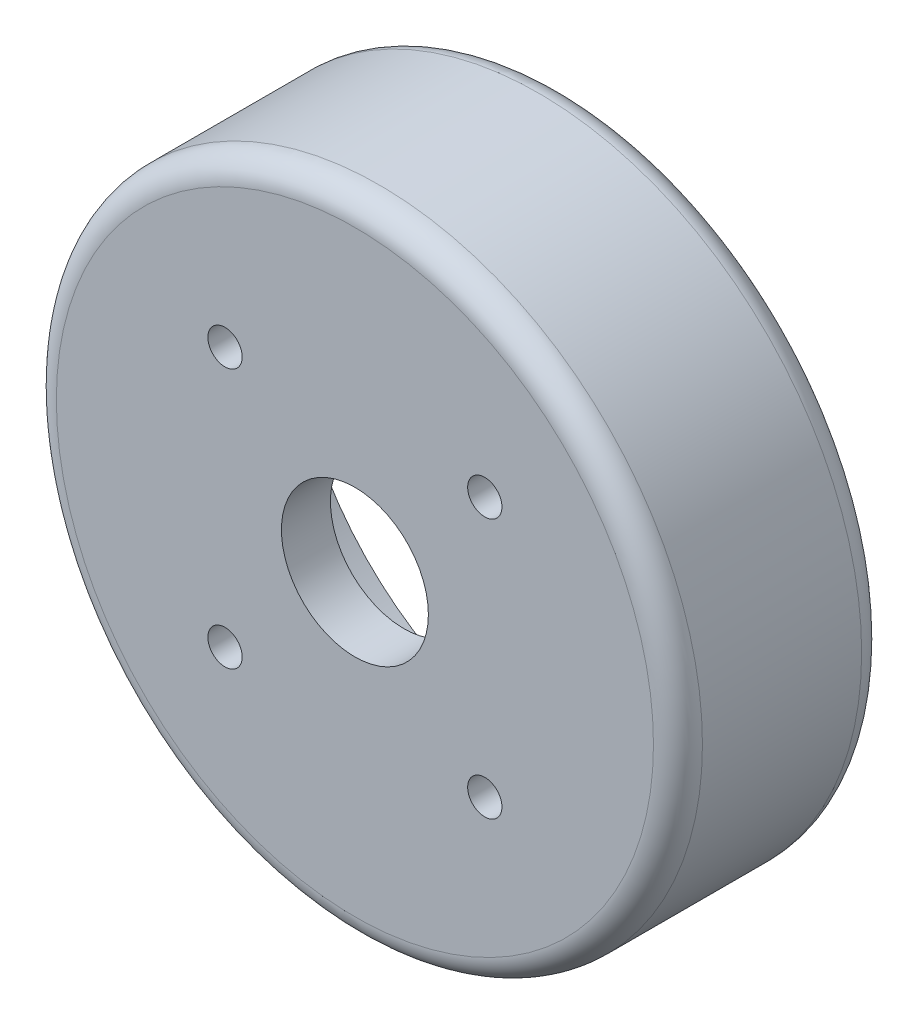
ISO-10303-21;
HEADER;
FILE_DESCRIPTION(('STEP AP214'),'2;1');
FILE_NAME('part.step','',(''),(''),'','','');
FILE_SCHEMA(('AUTOMOTIVE_DESIGN { 1 0 10303 214 1 1 1 1 }'));
ENDSEC;
DATA;
#1=APPLICATION_CONTEXT('core data for automotive mechanical design processes');
#2=APPLICATION_PROTOCOL_DEFINITION('international standard','automotive_design',2000,#1);
#3=PRODUCT_CONTEXT('',#1,'mechanical');
#4=PRODUCT('Part','Part','',(#3));
#5=PRODUCT_RELATED_PRODUCT_CATEGORY('part','',(#4));
#6=PRODUCT_DEFINITION_FORMATION('','',#4);
#7=PRODUCT_DEFINITION_CONTEXT('part definition',#1,'design');
#8=PRODUCT_DEFINITION('design','',#6,#7);
#9=PRODUCT_DEFINITION_SHAPE('','',#8);
#10=(LENGTH_UNIT() NAMED_UNIT(*) SI_UNIT(.MILLI.,.METRE.));
#11=(NAMED_UNIT(*) PLANE_ANGLE_UNIT() SI_UNIT($,.RADIAN.));
#12=(NAMED_UNIT(*) SI_UNIT($,.STERADIAN.) SOLID_ANGLE_UNIT());
#13=UNCERTAINTY_MEASURE_WITH_UNIT(LENGTH_MEASURE(1.E-05),#10,'distance_accuracy_value','');
#14=(GEOMETRIC_REPRESENTATION_CONTEXT(3) GLOBAL_UNCERTAINTY_ASSIGNED_CONTEXT((#13)) GLOBAL_UNIT_ASSIGNED_CONTEXT((#10,
#11,#12)) REPRESENTATION_CONTEXT('',''));
#15=CARTESIAN_POINT('',(0.,0.,0.));
#16=DIRECTION('',(0.,0.,1.));
#17=DIRECTION('',(1.,0.,0.));
#18=AXIS2_PLACEMENT_3D('',#15,#16,#17);
#19=CARTESIAN_POINT('',(-13.4703841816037,-13.4703841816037,8.89));
#20=DIRECTION('',(0.,0.,-1.));
#21=DIRECTION('',(-1.,0.,0.));
#22=AXIS2_PLACEMENT_3D('',#19,#20,#21);
#23=CYLINDRICAL_SURFACE('',#22,1.77799999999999);
#24=CARTESIAN_POINT('',(-13.4703841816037,-13.4703841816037,8.89));
#25=DIRECTION('',(0.,0.,-1.));
#26=DIRECTION('',(-1.,0.,0.));
#27=AXIS2_PLACEMENT_3D('',#24,#25,#26);
#28=CIRCLE('',#27,1.77799999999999);
#29=CARTESIAN_POINT('',(-15.2483841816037,-13.4703841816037,8.89));
#30=VERTEX_POINT('',#29);
#31=EDGE_CURVE('E396',#30,#30,#28,.T.);
#32=ORIENTED_EDGE('',*,*,#31,.F.);
#33=EDGE_LOOP('',(#32));
#34=FACE_BOUND('',#33,.T.);
#35=CARTESIAN_POINT('',(-13.4703841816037,-13.4703841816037,6.35));
#36=DIRECTION('',(0.,0.,-1.));
#37=DIRECTION('',(-1.,0.,0.));
#38=AXIS2_PLACEMENT_3D('',#35,#36,#37);
#39=CIRCLE('',#38,1.77799999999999);
#40=CARTESIAN_POINT('',(-15.2483841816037,-13.4703841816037,6.35));
#41=VERTEX_POINT('',#40);
#42=EDGE_CURVE('E366',#41,#41,#39,.F.);
#43=ORIENTED_EDGE('',*,*,#42,.F.);
#44=EDGE_LOOP('',(#43));
#45=FACE_BOUND('',#44,.T.);
#46=ADVANCED_FACE('F32',(#34,#45),#23,.F.);
#47=CARTESIAN_POINT('',(-13.4703841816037,13.4703841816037,8.89));
#48=DIRECTION('',(0.,0.,-1.));
#49=DIRECTION('',(-1.,0.,0.));
#50=AXIS2_PLACEMENT_3D('',#47,#48,#49);
#51=CYLINDRICAL_SURFACE('',#50,1.77799999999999);
#52=CARTESIAN_POINT('',(-13.4703841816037,13.4703841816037,8.89));
#53=DIRECTION('',(0.,0.,-1.));
#54=DIRECTION('',(-1.,0.,0.));
#55=AXIS2_PLACEMENT_3D('',#52,#53,#54);
#56=CIRCLE('',#55,1.77799999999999);
#57=CARTESIAN_POINT('',(-15.2483841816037,13.4703841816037,8.89));
#58=VERTEX_POINT('',#57);
#59=EDGE_CURVE('E400',#58,#58,#56,.T.);
#60=ORIENTED_EDGE('',*,*,#59,.F.);
#61=EDGE_LOOP('',(#60));
#62=FACE_BOUND('',#61,.T.);
#63=CARTESIAN_POINT('',(-13.4703841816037,13.4703841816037,6.35));
#64=DIRECTION('',(0.,0.,-1.));
#65=DIRECTION('',(-1.,0.,0.));
#66=AXIS2_PLACEMENT_3D('',#63,#64,#65);
#67=CIRCLE('',#66,1.77799999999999);
#68=CARTESIAN_POINT('',(-15.2483841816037,13.4703841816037,6.35));
#69=VERTEX_POINT('',#68);
#70=EDGE_CURVE('E428',#69,#69,#67,.F.);
#71=ORIENTED_EDGE('',*,*,#70,.F.);
#72=EDGE_LOOP('',(#71));
#73=FACE_BOUND('',#72,.T.);
#74=ADVANCED_FACE('F510',(#62,#73),#51,.F.);
#75=CARTESIAN_POINT('',(13.4703841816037,-13.4703841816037,8.89));
#76=DIRECTION('',(0.,0.,-1.));
#77=DIRECTION('',(-1.,0.,0.));
#78=AXIS2_PLACEMENT_3D('',#75,#76,#77);
#79=CYLINDRICAL_SURFACE('',#78,1.77799999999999);
#80=CARTESIAN_POINT('',(13.4703841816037,-13.4703841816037,8.89));
#81=DIRECTION('',(0.,0.,-1.));
#82=DIRECTION('',(-1.,0.,0.));
#83=AXIS2_PLACEMENT_3D('',#80,#81,#82);
#84=CIRCLE('',#83,1.77799999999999);
#85=CARTESIAN_POINT('',(11.6923841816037,-13.4703841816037,8.89));
#86=VERTEX_POINT('',#85);
#87=EDGE_CURVE('E393',#86,#86,#84,.T.);
#88=ORIENTED_EDGE('',*,*,#87,.F.);
#89=EDGE_LOOP('',(#88));
#90=FACE_BOUND('',#89,.T.);
#91=CARTESIAN_POINT('',(13.4703841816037,-13.4703841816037,6.35));
#92=DIRECTION('',(0.,0.,-1.));
#93=DIRECTION('',(-1.,0.,0.));
#94=AXIS2_PLACEMENT_3D('',#91,#92,#93);
#95=CIRCLE('',#94,1.77799999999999);
#96=CARTESIAN_POINT('',(11.6923841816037,-13.4703841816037,6.35));
#97=VERTEX_POINT('',#96);
#98=EDGE_CURVE('E242',#97,#97,#95,.F.);
#99=ORIENTED_EDGE('',*,*,#98,.F.);
#100=EDGE_LOOP('',(#99));
#101=FACE_BOUND('',#100,.T.);
#102=ADVANCED_FACE('F516',(#90,#101),#79,.F.);
#103=CARTESIAN_POINT('',(13.4703841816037,13.4703841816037,8.89));
#104=DIRECTION('',(0.,0.,-1.));
#105=DIRECTION('',(-1.,0.,0.));
#106=AXIS2_PLACEMENT_3D('',#103,#104,#105);
#107=CYLINDRICAL_SURFACE('',#106,1.77799999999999);
#108=CARTESIAN_POINT('',(13.4703841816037,13.4703841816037,8.89));
#109=DIRECTION('',(0.,0.,-1.));
#110=DIRECTION('',(-1.,0.,0.));
#111=AXIS2_PLACEMENT_3D('',#108,#109,#110);
#112=CIRCLE('',#111,1.77799999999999);
#113=CARTESIAN_POINT('',(11.6923841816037,13.4703841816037,8.89));
#114=VERTEX_POINT('',#113);
#115=EDGE_CURVE('E397',#114,#114,#112,.T.);
#116=ORIENTED_EDGE('',*,*,#115,.F.);
#117=EDGE_LOOP('',(#116));
#118=FACE_BOUND('',#117,.T.);
#119=CARTESIAN_POINT('',(13.4703841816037,13.4703841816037,6.35));
#120=DIRECTION('',(0.,0.,-1.));
#121=DIRECTION('',(-1.,0.,0.));
#122=AXIS2_PLACEMENT_3D('',#119,#120,#121);
#123=CIRCLE('',#122,1.77799999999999);
#124=CARTESIAN_POINT('',(11.6923841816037,13.4703841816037,6.35));
#125=VERTEX_POINT('',#124);
#126=EDGE_CURVE('E382',#125,#125,#123,.F.);
#127=ORIENTED_EDGE('',*,*,#126,.F.);
#128=EDGE_LOOP('',(#127));
#129=FACE_BOUND('',#128,.T.);
#130=ADVANCED_FACE('F452',(#118,#129),#107,.F.);
#131=CARTESIAN_POINT('',(0.,0.,-12.7));
#132=DIRECTION('',(0.,0.,1.));
#133=DIRECTION('',(1.,0.,0.));
#134=AXIS2_PLACEMENT_3D('',#131,#132,#133);
#135=CYLINDRICAL_SURFACE('',#134,33.5026);
#136=CARTESIAN_POINT('',(0.,0.,-10.16));
#137=DIRECTION('',(0.,0.,1.));
#138=DIRECTION('',(1.,0.,0.));
#139=AXIS2_PLACEMENT_3D('',#136,#137,#138);
#140=CIRCLE('',#139,33.5026);
#141=CARTESIAN_POINT('',(33.5026,0.,-10.16));
#142=VERTEX_POINT('',#141);
#143=EDGE_CURVE('E435',#142,#142,#140,.T.);
#144=ORIENTED_EDGE('',*,*,#143,.T.);
#145=EDGE_LOOP('',(#144));
#146=FACE_BOUND('',#145,.T.);
#147=CARTESIAN_POINT('',(0.,0.,6.35));
#148=DIRECTION('',(0.,0.,1.));
#149=DIRECTION('',(1.,0.,0.));
#150=AXIS2_PLACEMENT_3D('',#147,#148,#149);
#151=CIRCLE('',#150,33.5026);
#152=CARTESIAN_POINT('',(33.5026,0.,6.35));
#153=VERTEX_POINT('',#152);
#154=EDGE_CURVE('E423',#153,#153,#151,.F.);
#155=ORIENTED_EDGE('',*,*,#154,.T.);
#156=EDGE_LOOP('',(#155));
#157=FACE_BOUND('',#156,.T.);
#158=ADVANCED_FACE('F449',(#146,#157),#135,.T.);
#159=CARTESIAN_POINT('',(0.,0.,-12.7));
#160=DIRECTION('',(0.,0.,1.));
#161=DIRECTION('',(1.,0.,0.));
#162=AXIS2_PLACEMENT_3D('',#159,#160,#161);
#163=PLANE('',#162);
#164=CARTESIAN_POINT('',(0.,0.,-12.7));
#165=DIRECTION('',(0.,0.,1.));
#166=DIRECTION('',(1.,0.,0.));
#167=AXIS2_PLACEMENT_3D('',#164,#165,#166);
#168=CIRCLE('',#167,30.9626);
#169=CARTESIAN_POINT('',(30.9626,0.,-12.7));
#170=VERTEX_POINT('',#169);
#171=EDGE_CURVE('E40',#170,#170,#168,.F.);
#172=ORIENTED_EDGE('',*,*,#171,.T.);
#173=EDGE_LOOP('',(#172));
#174=FACE_BOUND('',#173,.T.);
#175=CARTESIAN_POINT('',(0.,0.,-12.7));
#176=DIRECTION('',(0.,0.,1.));
#177=DIRECTION('',(1.,0.,0.));
#178=AXIS2_PLACEMENT_3D('',#175,#176,#177);
#179=CIRCLE('',#178,28.4226);
#180=CARTESIAN_POINT('',(28.4226,0.,-12.7));
#181=VERTEX_POINT('',#180);
#182=EDGE_CURVE('E420',#181,#181,#179,.T.);
#183=ORIENTED_EDGE('',*,*,#182,.T.);
#184=EDGE_LOOP('',(#183));
#185=FACE_BOUND('',#184,.T.);
#186=ADVANCED_FACE('F440',(#174,#185),#163,.F.);
#187=CARTESIAN_POINT('',(0.,0.,-12.7));
#188=DIRECTION('',(0.,0.,1.));
#189=DIRECTION('',(1.,0.,0.));
#190=AXIS2_PLACEMENT_3D('',#187,#188,#189);
#191=CYLINDRICAL_SURFACE('',#190,28.4226);
#192=ORIENTED_EDGE('',*,*,#182,.F.);
#193=EDGE_LOOP('',(#192));
#194=FACE_BOUND('',#193,.T.);
#195=CARTESIAN_POINT('',(0.,0.,0.));
#196=DIRECTION('',(0.,0.,1.));
#197=DIRECTION('',(1.,0.,0.));
#198=AXIS2_PLACEMENT_3D('',#195,#196,#197);
#199=CIRCLE('',#198,28.4226);
#200=CARTESIAN_POINT('',(28.4226,0.,0.));
#201=VERTEX_POINT('',#200);
#202=EDGE_CURVE('E417',#201,#201,#199,.F.);
#203=ORIENTED_EDGE('',*,*,#202,.F.);
#204=EDGE_LOOP('',(#203));
#205=FACE_BOUND('',#204,.T.);
#206=ADVANCED_FACE('F497',(#194,#205),#191,.F.);
#207=CARTESIAN_POINT('',(0.,0.,0.));
#208=DIRECTION('',(0.,0.,1.));
#209=DIRECTION('',(1.,0.,0.));
#210=AXIS2_PLACEMENT_3D('',#207,#208,#209);
#211=PLANE('',#210);
#212=CARTESIAN_POINT('',(0.,0.,0.));
#213=DIRECTION('',(0.,0.,1.));
#214=DIRECTION('',(1.,0.,0.));
#215=AXIS2_PLACEMENT_3D('',#212,#213,#214);
#216=CIRCLE('',#215,25.4);
#217=CARTESIAN_POINT('',(-25.4,0.,0.));
#218=VERTEX_POINT('',#217);
#219=EDGE_CURVE('E414',#218,#218,#216,.T.);
#220=ORIENTED_EDGE('',*,*,#219,.T.);
#221=EDGE_LOOP('',(#220));
#222=FACE_BOUND('',#221,.T.);
#223=ORIENTED_EDGE('',*,*,#202,.T.);
#224=EDGE_LOOP('',(#223));
#225=FACE_BOUND('',#224,.T.);
#226=ADVANCED_FACE('F491',(#222,#225),#211,.F.);
#227=CARTESIAN_POINT('',(0.,0.,3.81));
#228=DIRECTION('',(0.,0.,-1.));
#229=DIRECTION('',(-1.,0.,0.));
#230=AXIS2_PLACEMENT_3D('',#227,#228,#229);
#231=CYLINDRICAL_SURFACE('',#230,25.4);
#232=CARTESIAN_POINT('',(0.,0.,3.81));
#233=DIRECTION('',(0.,0.,1.));
#234=DIRECTION('',(1.,0.,0.));
#235=AXIS2_PLACEMENT_3D('',#232,#233,#234);
#236=CIRCLE('',#235,25.4);
#237=CARTESIAN_POINT('',(-25.4,0.,3.81));
#238=VERTEX_POINT('',#237);
#239=EDGE_CURVE('E409',#238,#238,#236,.T.);
#240=CARTESIAN_POINT('',(-25.4,0.,3.81));
#241=CARTESIAN_POINT('',(-25.4,0.,3.7703125));
#242=CARTESIAN_POINT('',(-25.4,0.,3.730625));
#243=CARTESIAN_POINT('',(-25.4,0.,3.65125));
#244=CARTESIAN_POINT('',(-25.4,0.,3.6115625));
#245=CARTESIAN_POINT('',(-25.4,0.,3.5321875));
#246=CARTESIAN_POINT('',(-25.4,0.,3.4925));
#247=CARTESIAN_POINT('',(-25.4,0.,3.413125));
#248=CARTESIAN_POINT('',(-25.4,0.,3.3734375));
#249=CARTESIAN_POINT('',(-25.4,0.,3.2940625));
#250=CARTESIAN_POINT('',(-25.4,0.,3.254375));
#251=CARTESIAN_POINT('',(-25.4,0.,3.175));
#252=CARTESIAN_POINT('',(-25.4,0.,3.1353125));
#253=CARTESIAN_POINT('',(-25.4,0.,3.0559375));
#254=CARTESIAN_POINT('',(-25.4,0.,3.01625));
#255=CARTESIAN_POINT('',(-25.4,0.,2.936875));
#256=CARTESIAN_POINT('',(-25.4,0.,2.8971875));
#257=CARTESIAN_POINT('',(-25.4,0.,2.8178125));
#258=CARTESIAN_POINT('',(-25.4,0.,2.778125));
#259=CARTESIAN_POINT('',(-25.4,0.,2.69875));
#260=CARTESIAN_POINT('',(-25.4,0.,2.6590625));
#261=CARTESIAN_POINT('',(-25.4,0.,2.5796875));
#262=CARTESIAN_POINT('',(-25.4,0.,2.54));
#263=CARTESIAN_POINT('',(-25.4,0.,2.460625));
#264=CARTESIAN_POINT('',(-25.4,0.,2.4209375));
#265=CARTESIAN_POINT('',(-25.4,0.,2.3415625));
#266=CARTESIAN_POINT('',(-25.4,0.,2.301875));
#267=CARTESIAN_POINT('',(-25.4,0.,2.2225));
#268=CARTESIAN_POINT('',(-25.4,0.,2.1828125));
#269=CARTESIAN_POINT('',(-25.4,0.,2.1034375));
#270=CARTESIAN_POINT('',(-25.4,0.,2.06375));
#271=CARTESIAN_POINT('',(-25.4,0.,1.984375));
#272=CARTESIAN_POINT('',(-25.4,0.,1.9446875));
#273=CARTESIAN_POINT('',(-25.4,0.,1.8653125));
#274=CARTESIAN_POINT('',(-25.4,0.,1.825625));
#275=CARTESIAN_POINT('',(-25.4,0.,1.74625));
#276=CARTESIAN_POINT('',(-25.4,0.,1.7065625));
#277=CARTESIAN_POINT('',(-25.4,0.,1.6271875));
#278=CARTESIAN_POINT('',(-25.4,0.,1.5875));
#279=CARTESIAN_POINT('',(-25.4,0.,1.508125));
#280=CARTESIAN_POINT('',(-25.4,0.,1.4684375));
#281=CARTESIAN_POINT('',(-25.4,0.,1.3890625));
#282=CARTESIAN_POINT('',(-25.4,0.,1.349375));
#283=CARTESIAN_POINT('',(-25.4,0.,1.27));
#284=CARTESIAN_POINT('',(-25.4,0.,1.2303125));
#285=CARTESIAN_POINT('',(-25.4,0.,1.1509375));
#286=CARTESIAN_POINT('',(-25.4,0.,1.11125));
#287=CARTESIAN_POINT('',(-25.4,0.,1.031875));
#288=CARTESIAN_POINT('',(-25.4,0.,0.9921875));
#289=CARTESIAN_POINT('',(-25.4,0.,0.9128125));
#290=CARTESIAN_POINT('',(-25.4,0.,0.873125));
#291=CARTESIAN_POINT('',(-25.4,0.,0.79375));
#292=CARTESIAN_POINT('',(-25.4,0.,0.7540625));
#293=CARTESIAN_POINT('',(-25.4,0.,0.6746875));
#294=CARTESIAN_POINT('',(-25.4,0.,0.635));
#295=CARTESIAN_POINT('',(-25.4,0.,0.555625));
#296=CARTESIAN_POINT('',(-25.4,0.,0.5159375));
#297=CARTESIAN_POINT('',(-25.4,0.,0.4365625));
#298=CARTESIAN_POINT('',(-25.4,0.,0.396875));
#299=CARTESIAN_POINT('',(-25.4,0.,0.3175));
#300=CARTESIAN_POINT('',(-25.4,0.,0.2778125));
#301=CARTESIAN_POINT('',(-25.4,0.,0.1984375));
#302=CARTESIAN_POINT('',(-25.4,0.,0.15875));
#303=CARTESIAN_POINT('',(-25.4,0.,0.0793749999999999));
#304=CARTESIAN_POINT('',(-25.4,0.,0.0396874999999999));
#305=CARTESIAN_POINT('',(-25.4,0.,0.));
#306=B_SPLINE_CURVE_WITH_KNOTS('',3,(#240,#241,#242,#243,#244,#245,#246,#247,#248,#249,#250,
#251,#252,#253,#254,#255,#256,#257,#258,#259,#260,#261,#262,#263,#264,#265,#266,#267,#268,#269,
#270,#271,#272,#273,#274,#275,#276,#277,#278,#279,#280,#281,#282,#283,#284,#285,#286,#287,#288,
#289,#290,#291,#292,#293,#294,#295,#296,#297,#298,#299,#300,#301,#302,#303,#304,#305),
.UNSPECIFIED.,.F.,.F.,(4,2,2,2,2,2,2,2,2,2,2,2,2,2,2,2,2,2,2,2,2,2,2,2,2,2,2,2,2,2,2,2,4),(0.,
0.1190625,0.238125,0.3571875,0.47625,0.595312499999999,0.714375,0.833437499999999,
0.952499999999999,1.0715625,1.190625,1.3096875,1.42875,1.5478125,1.666875,1.7859375,1.905,
2.0240625,2.143125,2.2621875,2.38125,2.5003125,2.619375,2.7384375,2.8575,2.9765625,3.095625,
3.2146875,3.33375,3.4528125,3.571875,3.6909375,3.81),.UNSPECIFIED.);
#307=EDGE_CURVE('BSEAM484',#238,#218,#306,.T.);
#308=ORIENTED_EDGE('',*,*,#239,.T.);
#309=ORIENTED_EDGE('',*,*,#219,.F.);
#310=ORIENTED_EDGE('',*,*,#307,.T.);
#311=ORIENTED_EDGE('',*,*,#307,.F.);
#312=EDGE_LOOP('',(#308,#310,#309,#311));
#313=FACE_BOUND('',#312,.T.);
#314=ADVANCED_FACE('F484',(#313),#231,.F.);
#315=CARTESIAN_POINT('',(0.,0.,3.81));
#316=DIRECTION('',(0.,0.,1.));
#317=DIRECTION('',(1.,0.,0.));
#318=AXIS2_PLACEMENT_3D('',#315,#316,#317);
#319=PLANE('',#318);
#320=DIRECTION('',(-0.499999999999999,-0.86602540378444,0.));
#321=VECTOR('',#320,1.);
#322=CARTESIAN_POINT('',(-8.63103422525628,13.4703841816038,3.81));
#323=LINE('',#322,#321);
#324=CARTESIAN_POINT('',(-8.63103422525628,13.4703841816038,3.81));
#325=VERTEX_POINT('',#324);
#326=CARTESIAN_POINT('',(-11.05070920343,9.27938418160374,3.81));
#327=VERTEX_POINT('',#326);
#328=EDGE_CURVE('E229',#325,#327,#323,.T.);
#329=ORIENTED_EDGE('',*,*,#328,.F.);
#330=DIRECTION('',(0.500000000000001,-0.866025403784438,0.));
#331=VECTOR('',#330,1.);
#332=CARTESIAN_POINT('',(-11.05070920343,17.6613841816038,3.81));
#333=LINE('',#332,#331);
#334=CARTESIAN_POINT('',(-11.05070920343,17.6613841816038,3.81));
#335=VERTEX_POINT('',#334);
#336=EDGE_CURVE('E47',#335,#325,#333,.T.);
#337=ORIENTED_EDGE('',*,*,#336,.F.);
#338=DIRECTION('',(1.,0.,0.));
#339=VECTOR('',#338,1.);
#340=CARTESIAN_POINT('',(-15.8900591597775,17.6613841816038,3.81));
#341=LINE('',#340,#339);
#342=CARTESIAN_POINT('',(-15.8900591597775,17.6613841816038,3.81));
#343=VERTEX_POINT('',#342);
#344=EDGE_CURVE('E215',#343,#335,#341,.T.);
#345=ORIENTED_EDGE('',*,*,#344,.F.);
#346=DIRECTION('',(0.5,0.866025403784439,0.));
#347=VECTOR('',#346,1.);
#348=CARTESIAN_POINT('',(-18.3097341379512,13.4703841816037,3.81));
#349=LINE('',#348,#347);
#350=CARTESIAN_POINT('',(-18.3097341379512,13.4703841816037,3.81));
#351=VERTEX_POINT('',#350);
#352=EDGE_CURVE('E218',#351,#343,#349,.T.);
#353=ORIENTED_EDGE('',*,*,#352,.F.);
#354=DIRECTION('',(-0.500000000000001,0.866025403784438,0.));
#355=VECTOR('',#354,1.);
#356=CARTESIAN_POINT('',(-15.8900591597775,9.27938418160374,3.81));
#357=LINE('',#356,#355);
#358=CARTESIAN_POINT('',(-15.8900591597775,9.27938418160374,3.81));
#359=VERTEX_POINT('',#358);
#360=EDGE_CURVE('E235',#359,#351,#357,.T.);
#361=ORIENTED_EDGE('',*,*,#360,.F.);
#362=DIRECTION('',(-1.,0.,0.));
#363=VECTOR('',#362,1.);
#364=CARTESIAN_POINT('',(-11.05070920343,9.27938418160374,3.81));
#365=LINE('',#364,#363);
#366=EDGE_CURVE('E232',#327,#359,#365,.T.);
#367=ORIENTED_EDGE('',*,*,#366,.F.);
#368=EDGE_LOOP('',(#329,#337,#345,#353,#361,#367));
#369=FACE_BOUND('',#368,.T.);
#370=DIRECTION('',(-0.5,-0.866025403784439,0.));
#371=VECTOR('',#370,1.);
#372=CARTESIAN_POINT('',(-8.63103422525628,-13.4703841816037,3.81));
#373=LINE('',#372,#371);
#374=CARTESIAN_POINT('',(-8.63103422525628,-13.4703841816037,3.81));
#375=VERTEX_POINT('',#374);
#376=CARTESIAN_POINT('',(-11.05070920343,-17.6613841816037,3.81));
#377=VERTEX_POINT('',#376);
#378=EDGE_CURVE('E271',#375,#377,#373,.T.);
#379=ORIENTED_EDGE('',*,*,#378,.F.);
#380=DIRECTION('',(0.5,-0.866025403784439,0.));
#381=VECTOR('',#380,1.);
#382=CARTESIAN_POINT('',(-11.05070920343,-9.2793841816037,3.81));
#383=LINE('',#382,#381);
#384=CARTESIAN_POINT('',(-11.05070920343,-9.2793841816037,3.81));
#385=VERTEX_POINT('',#384);
#386=EDGE_CURVE('E55',#385,#375,#383,.T.);
#387=ORIENTED_EDGE('',*,*,#386,.F.);
#388=DIRECTION('',(1.,0.,0.));
#389=VECTOR('',#388,1.);
#390=CARTESIAN_POINT('',(-15.8900591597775,-9.27938418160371,3.81));
#391=LINE('',#390,#389);
#392=CARTESIAN_POINT('',(-15.8900591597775,-9.27938418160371,3.81));
#393=VERTEX_POINT('',#392);
#394=EDGE_CURVE('E254',#393,#385,#391,.T.);
#395=ORIENTED_EDGE('',*,*,#394,.F.);
#396=DIRECTION('',(0.499999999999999,0.866025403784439,0.));
#397=VECTOR('',#396,1.);
#398=CARTESIAN_POINT('',(-18.3097341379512,-13.4703841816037,3.81));
#399=LINE('',#398,#397);
#400=CARTESIAN_POINT('',(-18.3097341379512,-13.4703841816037,3.81));
#401=VERTEX_POINT('',#400);
#402=EDGE_CURVE('E281',#401,#393,#399,.T.);
#403=ORIENTED_EDGE('',*,*,#402,.F.);
#404=DIRECTION('',(-0.5,0.866025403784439,0.));
#405=VECTOR('',#404,1.);
#406=CARTESIAN_POINT('',(-15.8900591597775,-17.6613841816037,3.81));
#407=LINE('',#406,#405);
#408=CARTESIAN_POINT('',(-15.8900591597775,-17.6613841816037,3.81));
#409=VERTEX_POINT('',#408);
#410=EDGE_CURVE('E278',#409,#401,#407,.T.);
#411=ORIENTED_EDGE('',*,*,#410,.F.);
#412=DIRECTION('',(-1.,0.,0.));
#413=VECTOR('',#412,1.);
#414=CARTESIAN_POINT('',(-11.05070920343,-17.6613841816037,3.81));
#415=LINE('',#414,#413);
#416=EDGE_CURVE('E275',#377,#409,#415,.T.);
#417=ORIENTED_EDGE('',*,*,#416,.F.);
#418=EDGE_LOOP('',(#379,#387,#395,#403,#411,#417));
#419=FACE_BOUND('',#418,.T.);
#420=DIRECTION('',(0.5,0.866025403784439,0.));
#421=VECTOR('',#420,1.);
#422=CARTESIAN_POINT('',(8.63103422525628,-13.4703841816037,3.81));
#423=LINE('',#422,#421);
#424=CARTESIAN_POINT('',(8.63103422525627,-13.4703841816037,3.81));
#425=VERTEX_POINT('',#424);
#426=CARTESIAN_POINT('',(11.05070920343,-9.27938418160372,3.81));
#427=VERTEX_POINT('',#426);
#428=EDGE_CURVE('E318',#425,#427,#423,.T.);
#429=ORIENTED_EDGE('',*,*,#428,.F.);
#430=DIRECTION('',(-0.5,0.866025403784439,0.));
#431=VECTOR('',#430,1.);
#432=CARTESIAN_POINT('',(11.05070920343,-17.6613841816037,3.81));
#433=LINE('',#432,#431);
#434=CARTESIAN_POINT('',(11.05070920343,-17.6613841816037,3.81));
#435=VERTEX_POINT('',#434);
#436=EDGE_CURVE('E316',#435,#425,#433,.T.);
#437=ORIENTED_EDGE('',*,*,#436,.F.);
#438=DIRECTION('',(-1.,0.,0.));
#439=VECTOR('',#438,1.);
#440=CARTESIAN_POINT('',(15.8900591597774,-17.6613841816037,3.81));
#441=LINE('',#440,#439);
#442=CARTESIAN_POINT('',(15.8900591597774,-17.6613841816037,3.81));
#443=VERTEX_POINT('',#442);
#444=EDGE_CURVE('E300',#443,#435,#441,.T.);
#445=ORIENTED_EDGE('',*,*,#444,.F.);
#446=DIRECTION('',(-0.5,-0.866025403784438,0.));
#447=VECTOR('',#446,1.);
#448=CARTESIAN_POINT('',(18.3097341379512,-13.4703841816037,3.81));
#449=LINE('',#448,#447);
#450=CARTESIAN_POINT('',(18.3097341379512,-13.4703841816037,3.81));
#451=VERTEX_POINT('',#450);
#452=EDGE_CURVE('E327',#451,#443,#449,.T.);
#453=ORIENTED_EDGE('',*,*,#452,.F.);
#454=DIRECTION('',(0.5,-0.866025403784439,0.));
#455=VECTOR('',#454,1.);
#456=CARTESIAN_POINT('',(15.8900591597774,-9.27938418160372,3.81));
#457=LINE('',#456,#455);
#458=CARTESIAN_POINT('',(15.8900591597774,-9.27938418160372,3.81));
#459=VERTEX_POINT('',#458);
#460=EDGE_CURVE('E324',#459,#451,#457,.T.);
#461=ORIENTED_EDGE('',*,*,#460,.F.);
#462=DIRECTION('',(1.,0.,0.));
#463=VECTOR('',#462,1.);
#464=CARTESIAN_POINT('',(11.05070920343,-9.27938418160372,3.81));
#465=LINE('',#464,#463);
#466=EDGE_CURVE('E321',#427,#459,#465,.T.);
#467=ORIENTED_EDGE('',*,*,#466,.F.);
#468=EDGE_LOOP('',(#429,#437,#445,#453,#461,#467));
#469=FACE_BOUND('',#468,.T.);
#470=DIRECTION('',(0.499999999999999,0.866025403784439,0.));
#471=VECTOR('',#470,1.);
#472=CARTESIAN_POINT('',(8.63103422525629,13.4703841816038,3.81));
#473=LINE('',#472,#471);
#474=CARTESIAN_POINT('',(8.6310342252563,13.4703841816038,3.81));
#475=VERTEX_POINT('',#474);
#476=CARTESIAN_POINT('',(11.05070920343,17.6613841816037,3.81));
#477=VERTEX_POINT('',#476);
#478=EDGE_CURVE('E365',#475,#477,#473,.T.);
#479=ORIENTED_EDGE('',*,*,#478,.F.);
#480=DIRECTION('',(-0.5,0.866025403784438,0.));
#481=VECTOR('',#480,1.);
#482=CARTESIAN_POINT('',(11.05070920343,9.27938418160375,3.81));
#483=LINE('',#482,#481);
#484=CARTESIAN_POINT('',(11.05070920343,9.27938418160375,3.81));
#485=VERTEX_POINT('',#484);
#486=EDGE_CURVE('E363',#485,#475,#483,.T.);
#487=ORIENTED_EDGE('',*,*,#486,.F.);
#488=DIRECTION('',(-1.,0.,0.));
#489=VECTOR('',#488,1.);
#490=CARTESIAN_POINT('',(15.8900591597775,9.27938418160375,3.81));
#491=LINE('',#490,#489);
#492=CARTESIAN_POINT('',(15.8900591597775,9.27938418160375,3.81));
#493=VERTEX_POINT('',#492);
#494=EDGE_CURVE('E347',#493,#485,#491,.T.);
#495=ORIENTED_EDGE('',*,*,#494,.F.);
#496=DIRECTION('',(-0.499999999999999,-0.866025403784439,0.));
#497=VECTOR('',#496,1.);
#498=CARTESIAN_POINT('',(18.3097341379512,13.4703841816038,3.81));
#499=LINE('',#498,#497);
#500=CARTESIAN_POINT('',(18.3097341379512,13.4703841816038,3.81));
#501=VERTEX_POINT('',#500);
#502=EDGE_CURVE('E375',#501,#493,#499,.T.);
#503=ORIENTED_EDGE('',*,*,#502,.F.);
#504=DIRECTION('',(0.500000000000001,-0.866025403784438,0.));
#505=VECTOR('',#504,1.);
#506=CARTESIAN_POINT('',(15.8900591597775,17.6613841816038,3.81));
#507=LINE('',#506,#505);
#508=CARTESIAN_POINT('',(15.8900591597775,17.6613841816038,3.81));
#509=VERTEX_POINT('',#508);
#510=EDGE_CURVE('E372',#509,#501,#507,.T.);
#511=ORIENTED_EDGE('',*,*,#510,.F.);
#512=DIRECTION('',(1.,0.,0.));
#513=VECTOR('',#512,1.);
#514=CARTESIAN_POINT('',(11.05070920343,17.6613841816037,3.81));
#515=LINE('',#514,#513);
#516=EDGE_CURVE('E369',#477,#509,#515,.T.);
#517=ORIENTED_EDGE('',*,*,#516,.F.);
#518=EDGE_LOOP('',(#479,#487,#495,#503,#511,#517));
#519=FACE_BOUND('',#518,.T.);
#520=CARTESIAN_POINT('',(0.,0.,3.81));
#521=DIRECTION('',(0.,0.,1.));
#522=DIRECTION('',(1.,0.,0.));
#523=AXIS2_PLACEMENT_3D('',#520,#521,#522);
#524=CIRCLE('',#523,7.62);
#525=CARTESIAN_POINT('',(7.62,0.,3.81));
#526=VERTEX_POINT('',#525);
#527=EDGE_CURVE('E405',#526,#526,#524,.T.);
#528=ORIENTED_EDGE('',*,*,#527,.T.);
#529=EDGE_LOOP('',(#528));
#530=FACE_BOUND('',#529,.T.);
#531=ORIENTED_EDGE('',*,*,#239,.F.);
#532=EDGE_LOOP('',(#531));
#533=FACE_BOUND('',#532,.T.);
#534=ADVANCED_FACE('F464',(#369,#419,#469,#519,#530,#533),#319,.F.);
#535=CARTESIAN_POINT('',(0.,0.,8.89));
#536=DIRECTION('',(0.,0.,1.));
#537=DIRECTION('',(1.,0.,0.));
#538=AXIS2_PLACEMENT_3D('',#535,#536,#537);
#539=PLANE('',#538);
#540=CARTESIAN_POINT('',(0.,0.,8.89));
#541=DIRECTION('',(0.,0.,1.));
#542=DIRECTION('',(1.,0.,0.));
#543=AXIS2_PLACEMENT_3D('',#540,#541,#542);
#544=CIRCLE('',#543,30.9626);
#545=CARTESIAN_POINT('',(30.9626,0.,8.89));
#546=VERTEX_POINT('',#545);
#547=EDGE_CURVE('E11',#546,#546,#544,.T.);
#548=ORIENTED_EDGE('',*,*,#547,.T.);
#549=EDGE_LOOP('',(#548));
#550=FACE_BOUND('',#549,.T.);
#551=ORIENTED_EDGE('',*,*,#87,.T.);
#552=EDGE_LOOP('',(#551));
#553=FACE_BOUND('',#552,.T.);
#554=ORIENTED_EDGE('',*,*,#115,.T.);
#555=EDGE_LOOP('',(#554));
#556=FACE_BOUND('',#555,.T.);
#557=ORIENTED_EDGE('',*,*,#59,.T.);
#558=EDGE_LOOP('',(#557));
#559=FACE_BOUND('',#558,.T.);
#560=ORIENTED_EDGE('',*,*,#31,.T.);
#561=EDGE_LOOP('',(#560));
#562=FACE_BOUND('',#561,.T.);
#563=CARTESIAN_POINT('',(0.,0.,8.89));
#564=DIRECTION('',(0.,0.,1.));
#565=DIRECTION('',(1.,0.,0.));
#566=AXIS2_PLACEMENT_3D('',#563,#564,#565);
#567=CIRCLE('',#566,7.62);
#568=CARTESIAN_POINT('',(7.62,0.,8.89));
#569=VERTEX_POINT('',#568);
#570=EDGE_CURVE('E406',#569,#569,#567,.T.);
#571=ORIENTED_EDGE('',*,*,#570,.F.);
#572=EDGE_LOOP('',(#571));
#573=FACE_BOUND('',#572,.T.);
#574=ADVANCED_FACE('F460',(#550,#553,#556,#559,#562,#573),#539,.T.);
#575=CARTESIAN_POINT('',(0.,0.,8.89));
#576=DIRECTION('',(0.,0.,-1.));
#577=DIRECTION('',(-1.,0.,0.));
#578=AXIS2_PLACEMENT_3D('',#575,#576,#577);
#579=CYLINDRICAL_SURFACE('',#578,7.62);
#580=ORIENTED_EDGE('',*,*,#570,.T.);
#581=EDGE_LOOP('',(#580));
#582=FACE_BOUND('',#581,.T.);
#583=ORIENTED_EDGE('',*,*,#527,.F.);
#584=EDGE_LOOP('',(#583));
#585=FACE_BOUND('',#584,.T.);
#586=ADVANCED_FACE('F463',(#582,#585),#579,.F.);
#587=CARTESIAN_POINT('',(0.,0.,6.35));
#588=DIRECTION('',(0.,0.,-1.));
#589=DIRECTION('',(-1.,0.,0.));
#590=AXIS2_PLACEMENT_3D('',#587,#588,#589);
#591=PLANE('',#590);
#592=DIRECTION('',(-0.5,0.866025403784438,0.));
#593=VECTOR('',#592,1.);
#594=CARTESIAN_POINT('',(11.05070920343,9.27938418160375,6.35));
#595=LINE('',#594,#593);
#596=CARTESIAN_POINT('',(11.05070920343,9.27938418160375,6.35));
#597=VERTEX_POINT('',#596);
#598=CARTESIAN_POINT('',(8.63103422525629,13.4703841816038,6.35));
#599=VERTEX_POINT('',#598);
#600=EDGE_CURVE('E343',#597,#599,#595,.T.);
#601=ORIENTED_EDGE('',*,*,#600,.T.);
#602=DIRECTION('',(0.499999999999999,0.866025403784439,0.));
#603=VECTOR('',#602,1.);
#604=CARTESIAN_POINT('',(8.63103422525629,13.4703841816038,6.35));
#605=LINE('',#604,#603);
#606=CARTESIAN_POINT('',(11.05070920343,17.6613841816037,6.35));
#607=VERTEX_POINT('',#606);
#608=EDGE_CURVE('E346',#599,#607,#605,.T.);
#609=ORIENTED_EDGE('',*,*,#608,.T.);
#610=DIRECTION('',(1.,0.,0.));
#611=VECTOR('',#610,1.);
#612=CARTESIAN_POINT('',(11.05070920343,17.6613841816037,6.35));
#613=LINE('',#612,#611);
#614=CARTESIAN_POINT('',(15.8900591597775,17.6613841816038,6.35));
#615=VERTEX_POINT('',#614);
#616=EDGE_CURVE('E350',#607,#615,#613,.T.);
#617=ORIENTED_EDGE('',*,*,#616,.T.);
#618=DIRECTION('',(0.500000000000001,-0.866025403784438,0.));
#619=VECTOR('',#618,1.);
#620=CARTESIAN_POINT('',(15.8900591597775,17.6613841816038,6.35));
#621=LINE('',#620,#619);
#622=CARTESIAN_POINT('',(18.3097341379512,13.4703841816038,6.35));
#623=VERTEX_POINT('',#622);
#624=EDGE_CURVE('E353',#615,#623,#621,.T.);
#625=ORIENTED_EDGE('',*,*,#624,.T.);
#626=DIRECTION('',(-0.499999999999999,-0.866025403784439,0.));
#627=VECTOR('',#626,1.);
#628=CARTESIAN_POINT('',(18.3097341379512,13.4703841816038,6.35));
#629=LINE('',#628,#627);
#630=CARTESIAN_POINT('',(15.8900591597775,9.27938418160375,6.35));
#631=VERTEX_POINT('',#630);
#632=EDGE_CURVE('E356',#623,#631,#629,.T.);
#633=ORIENTED_EDGE('',*,*,#632,.T.);
#634=DIRECTION('',(-1.,0.,0.));
#635=VECTOR('',#634,1.);
#636=CARTESIAN_POINT('',(15.8900591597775,9.27938418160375,6.35));
#637=LINE('',#636,#635);
#638=EDGE_CURVE('E359',#631,#597,#637,.T.);
#639=ORIENTED_EDGE('',*,*,#638,.T.);
#640=EDGE_LOOP('',(#601,#609,#617,#625,#633,#639));
#641=FACE_BOUND('',#640,.T.);
#642=ORIENTED_EDGE('',*,*,#126,.T.);
#643=EDGE_LOOP('',(#642));
#644=FACE_BOUND('',#643,.T.);
#645=ADVANCED_FACE('F478',(#641,#644),#591,.T.);
#646=CARTESIAN_POINT('',(11.05070920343,9.27938418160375,6.35));
#647=DIRECTION('',(-0.866025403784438,-0.5,0.));
#648=DIRECTION('',(0.5,-0.866025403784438,0.));
#649=AXIS2_PLACEMENT_3D('',#646,#647,#648);
#650=PLANE('',#649);
#651=ORIENTED_EDGE('',*,*,#486,.T.);
#652=DIRECTION('',(0.,0.,-1.));
#653=VECTOR('',#652,1.);
#654=CARTESIAN_POINT('',(8.63103422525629,13.4703841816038,6.35));
#655=LINE('',#654,#653);
#656=EDGE_CURVE('E362',#599,#475,#655,.T.);
#657=ORIENTED_EDGE('',*,*,#656,.F.);
#658=ORIENTED_EDGE('',*,*,#600,.F.);
#659=DIRECTION('',(0.,0.,-1.));
#660=VECTOR('',#659,1.);
#661=CARTESIAN_POINT('',(11.05070920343,9.27938418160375,6.35));
#662=LINE('',#661,#660);
#663=EDGE_CURVE('E380',#597,#485,#662,.T.);
#664=ORIENTED_EDGE('',*,*,#663,.T.);
#665=EDGE_LOOP('',(#651,#657,#658,#664));
#666=FACE_BOUND('',#665,.T.);
#667=ADVANCED_FACE('F527',(#666),#650,.F.);
#668=CARTESIAN_POINT('',(15.8900591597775,9.27938418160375,6.35));
#669=DIRECTION('',(0.,-1.,0.));
#670=DIRECTION('',(1.,0.,0.));
#671=AXIS2_PLACEMENT_3D('',#668,#669,#670);
#672=PLANE('',#671);
#673=ORIENTED_EDGE('',*,*,#494,.T.);
#674=ORIENTED_EDGE('',*,*,#663,.F.);
#675=ORIENTED_EDGE('',*,*,#638,.F.);
#676=DIRECTION('',(0.,0.,-1.));
#677=VECTOR('',#676,1.);
#678=CARTESIAN_POINT('',(15.8900591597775,9.27938418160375,6.35));
#679=LINE('',#678,#677);
#680=EDGE_CURVE('E383',#631,#493,#679,.T.);
#681=ORIENTED_EDGE('',*,*,#680,.T.);
#682=EDGE_LOOP('',(#673,#674,#675,#681));
#683=FACE_BOUND('',#682,.T.);
#684=ADVANCED_FACE('F530',(#683),#672,.F.);
#685=CARTESIAN_POINT('',(18.3097341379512,13.4703841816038,6.35));
#686=DIRECTION('',(0.866025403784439,-0.499999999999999,0.));
#687=DIRECTION('',(0.499999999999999,0.866025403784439,0.));
#688=AXIS2_PLACEMENT_3D('',#685,#686,#687);
#689=PLANE('',#688);
#690=ORIENTED_EDGE('',*,*,#502,.T.);
#691=ORIENTED_EDGE('',*,*,#680,.F.);
#692=ORIENTED_EDGE('',*,*,#632,.F.);
#693=DIRECTION('',(0.,0.,-1.));
#694=VECTOR('',#693,1.);
#695=CARTESIAN_POINT('',(18.3097341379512,13.4703841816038,6.35));
#696=LINE('',#695,#694);
#697=EDGE_CURVE('E385',#623,#501,#696,.T.);
#698=ORIENTED_EDGE('',*,*,#697,.T.);
#699=EDGE_LOOP('',(#690,#691,#692,#698));
#700=FACE_BOUND('',#699,.T.);
#701=ADVANCED_FACE('F544',(#700),#689,.F.);
#702=CARTESIAN_POINT('',(15.8900591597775,17.6613841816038,6.35));
#703=DIRECTION('',(0.866025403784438,0.500000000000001,0.));
#704=DIRECTION('',(-0.500000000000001,0.866025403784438,0.));
#705=AXIS2_PLACEMENT_3D('',#702,#703,#704);
#706=PLANE('',#705);
#707=ORIENTED_EDGE('',*,*,#510,.T.);
#708=ORIENTED_EDGE('',*,*,#697,.F.);
#709=ORIENTED_EDGE('',*,*,#624,.F.);
#710=DIRECTION('',(0.,0.,-1.));
#711=VECTOR('',#710,1.);
#712=CARTESIAN_POINT('',(15.8900591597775,17.6613841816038,6.35));
#713=LINE('',#712,#711);
#714=EDGE_CURVE('E387',#615,#509,#713,.T.);
#715=ORIENTED_EDGE('',*,*,#714,.T.);
#716=EDGE_LOOP('',(#707,#708,#709,#715));
#717=FACE_BOUND('',#716,.T.);
#718=ADVANCED_FACE('F540',(#717),#706,.F.);
#719=CARTESIAN_POINT('',(11.05070920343,17.6613841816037,6.35));
#720=DIRECTION('',(0.,1.,0.));
#721=DIRECTION('',(-1.,0.,0.));
#722=AXIS2_PLACEMENT_3D('',#719,#720,#721);
#723=PLANE('',#722);
#724=ORIENTED_EDGE('',*,*,#516,.T.);
#725=ORIENTED_EDGE('',*,*,#714,.F.);
#726=ORIENTED_EDGE('',*,*,#616,.F.);
#727=DIRECTION('',(0.,0.,-1.));
#728=VECTOR('',#727,1.);
#729=CARTESIAN_POINT('',(11.05070920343,17.6613841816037,6.35));
#730=LINE('',#729,#728);
#731=EDGE_CURVE('E389',#607,#477,#730,.T.);
#732=ORIENTED_EDGE('',*,*,#731,.T.);
#733=EDGE_LOOP('',(#724,#725,#726,#732));
#734=FACE_BOUND('',#733,.T.);
#735=ADVANCED_FACE('F536',(#734),#723,.F.);
#736=CARTESIAN_POINT('',(8.63103422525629,13.4703841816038,6.35));
#737=DIRECTION('',(-0.866025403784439,0.499999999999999,0.));
#738=DIRECTION('',(-0.499999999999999,-0.866025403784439,0.));
#739=AXIS2_PLACEMENT_3D('',#736,#737,#738);
#740=PLANE('',#739);
#741=ORIENTED_EDGE('',*,*,#478,.T.);
#742=ORIENTED_EDGE('',*,*,#731,.F.);
#743=ORIENTED_EDGE('',*,*,#608,.F.);
#744=ORIENTED_EDGE('',*,*,#656,.T.);
#745=EDGE_LOOP('',(#741,#742,#743,#744));
#746=FACE_BOUND('',#745,.T.);
#747=ADVANCED_FACE('F532',(#746),#740,.F.);
#748=CARTESIAN_POINT('',(0.,0.,6.35));
#749=DIRECTION('',(0.,0.,-1.));
#750=DIRECTION('',(-1.,0.,0.));
#751=AXIS2_PLACEMENT_3D('',#748,#749,#750);
#752=PLANE('',#751);
#753=DIRECTION('',(-0.5,0.866025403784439,0.));
#754=VECTOR('',#753,1.);
#755=CARTESIAN_POINT('',(11.05070920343,-17.6613841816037,6.35));
#756=LINE('',#755,#754);
#757=CARTESIAN_POINT('',(11.05070920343,-17.6613841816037,6.35));
#758=VERTEX_POINT('',#757);
#759=CARTESIAN_POINT('',(8.63103422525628,-13.4703841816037,6.35));
#760=VERTEX_POINT('',#759);
#761=EDGE_CURVE('E296',#758,#760,#756,.T.);
#762=ORIENTED_EDGE('',*,*,#761,.T.);
#763=DIRECTION('',(0.5,0.866025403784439,0.));
#764=VECTOR('',#763,1.);
#765=CARTESIAN_POINT('',(8.63103422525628,-13.4703841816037,6.35));
#766=LINE('',#765,#764);
#767=CARTESIAN_POINT('',(11.05070920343,-9.27938418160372,6.35));
#768=VERTEX_POINT('',#767);
#769=EDGE_CURVE('E299',#760,#768,#766,.T.);
#770=ORIENTED_EDGE('',*,*,#769,.T.);
#771=DIRECTION('',(1.,0.,0.));
#772=VECTOR('',#771,1.);
#773=CARTESIAN_POINT('',(11.05070920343,-9.27938418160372,6.35));
#774=LINE('',#773,#772);
#775=CARTESIAN_POINT('',(15.8900591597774,-9.27938418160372,6.35));
#776=VERTEX_POINT('',#775);
#777=EDGE_CURVE('E303',#768,#776,#774,.T.);
#778=ORIENTED_EDGE('',*,*,#777,.T.);
#779=DIRECTION('',(0.5,-0.866025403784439,0.));
#780=VECTOR('',#779,1.);
#781=CARTESIAN_POINT('',(15.8900591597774,-9.27938418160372,6.35));
#782=LINE('',#781,#780);
#783=CARTESIAN_POINT('',(18.3097341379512,-13.4703841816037,6.35));
#784=VERTEX_POINT('',#783);
#785=EDGE_CURVE('E306',#776,#784,#782,.T.);
#786=ORIENTED_EDGE('',*,*,#785,.T.);
#787=DIRECTION('',(-0.5,-0.866025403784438,0.));
#788=VECTOR('',#787,1.);
#789=CARTESIAN_POINT('',(18.3097341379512,-13.4703841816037,6.35));
#790=LINE('',#789,#788);
#791=CARTESIAN_POINT('',(15.8900591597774,-17.6613841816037,6.35));
#792=VERTEX_POINT('',#791);
#793=EDGE_CURVE('E309',#784,#792,#790,.T.);
#794=ORIENTED_EDGE('',*,*,#793,.T.);
#795=DIRECTION('',(-1.,0.,0.));
#796=VECTOR('',#795,1.);
#797=CARTESIAN_POINT('',(15.8900591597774,-17.6613841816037,6.35));
#798=LINE('',#797,#796);
#799=EDGE_CURVE('E312',#792,#758,#798,.T.);
#800=ORIENTED_EDGE('',*,*,#799,.T.);
#801=EDGE_LOOP('',(#762,#770,#778,#786,#794,#800));
#802=FACE_BOUND('',#801,.T.);
#803=ORIENTED_EDGE('',*,*,#98,.T.);
#804=EDGE_LOOP('',(#803));
#805=FACE_BOUND('',#804,.T.);
#806=ADVANCED_FACE('F535',(#802,#805),#752,.T.);
#807=CARTESIAN_POINT('',(11.05070920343,-17.6613841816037,6.35));
#808=DIRECTION('',(-0.866025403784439,-0.5,0.));
#809=DIRECTION('',(0.5,-0.866025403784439,0.));
#810=AXIS2_PLACEMENT_3D('',#807,#808,#809);
#811=PLANE('',#810);
#812=ORIENTED_EDGE('',*,*,#436,.T.);
#813=DIRECTION('',(0.,0.,-1.));
#814=VECTOR('',#813,1.);
#815=CARTESIAN_POINT('',(8.63103422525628,-13.4703841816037,6.35));
#816=LINE('',#815,#814);
#817=EDGE_CURVE('E315',#760,#425,#816,.T.);
#818=ORIENTED_EDGE('',*,*,#817,.F.);
#819=ORIENTED_EDGE('',*,*,#761,.F.);
#820=DIRECTION('',(0.,0.,-1.));
#821=VECTOR('',#820,1.);
#822=CARTESIAN_POINT('',(11.05070920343,-17.6613841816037,6.35));
#823=LINE('',#822,#821);
#824=EDGE_CURVE('E272',#758,#435,#823,.T.);
#825=ORIENTED_EDGE('',*,*,#824,.T.);
#826=EDGE_LOOP('',(#812,#818,#819,#825));
#827=FACE_BOUND('',#826,.T.);
#828=ADVANCED_FACE('F555',(#827),#811,.F.);
#829=CARTESIAN_POINT('',(15.8900591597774,-17.6613841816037,6.35));
#830=DIRECTION('',(0.,-1.,0.));
#831=DIRECTION('',(0.,0.,-1.));
#832=AXIS2_PLACEMENT_3D('',#829,#830,#831);
#833=PLANE('',#832);
#834=ORIENTED_EDGE('',*,*,#444,.T.);
#835=ORIENTED_EDGE('',*,*,#824,.F.);
#836=ORIENTED_EDGE('',*,*,#799,.F.);
#837=DIRECTION('',(0.,0.,-1.));
#838=VECTOR('',#837,1.);
#839=CARTESIAN_POINT('',(15.8900591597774,-17.6613841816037,6.35));
#840=LINE('',#839,#838);
#841=EDGE_CURVE('E333',#792,#443,#840,.T.);
#842=ORIENTED_EDGE('',*,*,#841,.T.);
#843=EDGE_LOOP('',(#834,#835,#836,#842));
#844=FACE_BOUND('',#843,.T.);
#845=ADVANCED_FACE('F558',(#844),#833,.F.);
#846=CARTESIAN_POINT('',(18.3097341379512,-13.4703841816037,6.35));
#847=DIRECTION('',(0.866025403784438,-0.5,0.));
#848=DIRECTION('',(0.500000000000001,0.866025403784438,0.));
#849=AXIS2_PLACEMENT_3D('',#846,#847,#848);
#850=PLANE('',#849);
#851=ORIENTED_EDGE('',*,*,#452,.T.);
#852=ORIENTED_EDGE('',*,*,#841,.F.);
#853=ORIENTED_EDGE('',*,*,#793,.F.);
#854=DIRECTION('',(0.,0.,-1.));
#855=VECTOR('',#854,1.);
#856=CARTESIAN_POINT('',(18.3097341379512,-13.4703841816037,6.35));
#857=LINE('',#856,#855);
#858=EDGE_CURVE('E335',#784,#451,#857,.T.);
#859=ORIENTED_EDGE('',*,*,#858,.T.);
#860=EDGE_LOOP('',(#851,#852,#853,#859));
#861=FACE_BOUND('',#860,.T.);
#862=ADVANCED_FACE('F571',(#861),#850,.F.);
#863=CARTESIAN_POINT('',(15.8900591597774,-9.27938418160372,6.35));
#864=DIRECTION('',(0.866025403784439,0.5,0.));
#865=DIRECTION('',(-0.5,0.866025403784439,0.));
#866=AXIS2_PLACEMENT_3D('',#863,#864,#865);
#867=PLANE('',#866);
#868=ORIENTED_EDGE('',*,*,#460,.T.);
#869=ORIENTED_EDGE('',*,*,#858,.F.);
#870=ORIENTED_EDGE('',*,*,#785,.F.);
#871=DIRECTION('',(0.,0.,-1.));
#872=VECTOR('',#871,1.);
#873=CARTESIAN_POINT('',(15.8900591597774,-9.27938418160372,6.35));
#874=LINE('',#873,#872);
#875=EDGE_CURVE('E337',#776,#459,#874,.T.);
#876=ORIENTED_EDGE('',*,*,#875,.T.);
#877=EDGE_LOOP('',(#868,#869,#870,#876));
#878=FACE_BOUND('',#877,.T.);
#879=ADVANCED_FACE('F567',(#878),#867,.F.);
#880=CARTESIAN_POINT('',(11.05070920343,-9.27938418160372,6.35));
#881=DIRECTION('',(0.,1.,0.));
#882=DIRECTION('',(0.,0.,1.));
#883=AXIS2_PLACEMENT_3D('',#880,#881,#882);
#884=PLANE('',#883);
#885=ORIENTED_EDGE('',*,*,#466,.T.);
#886=ORIENTED_EDGE('',*,*,#875,.F.);
#887=ORIENTED_EDGE('',*,*,#777,.F.);
#888=DIRECTION('',(0.,0.,-1.));
#889=VECTOR('',#888,1.);
#890=CARTESIAN_POINT('',(11.05070920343,-9.27938418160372,6.35));
#891=LINE('',#890,#889);
#892=EDGE_CURVE('E339',#768,#427,#891,.T.);
#893=ORIENTED_EDGE('',*,*,#892,.T.);
#894=EDGE_LOOP('',(#885,#886,#887,#893));
#895=FACE_BOUND('',#894,.T.);
#896=ADVANCED_FACE('F563',(#895),#884,.F.);
#897=CARTESIAN_POINT('',(8.63103422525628,-13.4703841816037,6.35));
#898=DIRECTION('',(-0.866025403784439,0.5,0.));
#899=DIRECTION('',(-0.5,-0.866025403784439,0.));
#900=AXIS2_PLACEMENT_3D('',#897,#898,#899);
#901=PLANE('',#900);
#902=ORIENTED_EDGE('',*,*,#428,.T.);
#903=ORIENTED_EDGE('',*,*,#892,.F.);
#904=ORIENTED_EDGE('',*,*,#769,.F.);
#905=ORIENTED_EDGE('',*,*,#817,.T.);
#906=EDGE_LOOP('',(#902,#903,#904,#905));
#907=FACE_BOUND('',#906,.T.);
#908=ADVANCED_FACE('F560',(#907),#901,.F.);
#909=CARTESIAN_POINT('',(0.,0.,6.35));
#910=DIRECTION('',(0.,0.,-1.));
#911=DIRECTION('',(-1.,0.,0.));
#912=AXIS2_PLACEMENT_3D('',#909,#910,#911);
#913=PLANE('',#912);
#914=DIRECTION('',(0.500000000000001,-0.866025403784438,0.));
#915=VECTOR('',#914,1.);
#916=CARTESIAN_POINT('',(-11.05070920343,17.6613841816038,6.35));
#917=LINE('',#916,#915);
#918=CARTESIAN_POINT('',(-11.05070920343,17.6613841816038,6.35));
#919=VERTEX_POINT('',#918);
#920=CARTESIAN_POINT('',(-8.63103422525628,13.4703841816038,6.35));
#921=VERTEX_POINT('',#920);
#922=EDGE_CURVE('E195',#919,#921,#917,.T.);
#923=ORIENTED_EDGE('',*,*,#922,.T.);
#924=DIRECTION('',(-0.499999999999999,-0.86602540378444,0.));
#925=VECTOR('',#924,1.);
#926=CARTESIAN_POINT('',(-8.63103422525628,13.4703841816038,6.35));
#927=LINE('',#926,#925);
#928=CARTESIAN_POINT('',(-11.05070920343,9.27938418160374,6.35));
#929=VERTEX_POINT('',#928);
#930=EDGE_CURVE('E204',#921,#929,#927,.T.);
#931=ORIENTED_EDGE('',*,*,#930,.T.);
#932=DIRECTION('',(-1.,0.,0.));
#933=VECTOR('',#932,1.);
#934=CARTESIAN_POINT('',(-11.05070920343,9.27938418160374,6.35));
#935=LINE('',#934,#933);
#936=CARTESIAN_POINT('',(-15.8900591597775,9.27938418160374,6.35));
#937=VERTEX_POINT('',#936);
#938=EDGE_CURVE('E209',#929,#937,#935,.T.);
#939=ORIENTED_EDGE('',*,*,#938,.T.);
#940=DIRECTION('',(-0.500000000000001,0.866025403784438,0.));
#941=VECTOR('',#940,1.);
#942=CARTESIAN_POINT('',(-15.8900591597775,9.27938418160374,6.35));
#943=LINE('',#942,#941);
#944=CARTESIAN_POINT('',(-18.3097341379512,13.4703841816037,6.35));
#945=VERTEX_POINT('',#944);
#946=EDGE_CURVE('E222',#937,#945,#943,.T.);
#947=ORIENTED_EDGE('',*,*,#946,.T.);
#948=DIRECTION('',(0.5,0.866025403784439,0.));
#949=VECTOR('',#948,1.);
#950=CARTESIAN_POINT('',(-18.3097341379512,13.4703841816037,6.35));
#951=LINE('',#950,#949);
#952=CARTESIAN_POINT('',(-15.8900591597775,17.6613841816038,6.35));
#953=VERTEX_POINT('',#952);
#954=EDGE_CURVE('E225',#945,#953,#951,.T.);
#955=ORIENTED_EDGE('',*,*,#954,.T.);
#956=DIRECTION('',(1.,0.,0.));
#957=VECTOR('',#956,1.);
#958=CARTESIAN_POINT('',(-15.8900591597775,17.6613841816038,6.35));
#959=LINE('',#958,#957);
#960=EDGE_CURVE('E201',#953,#919,#959,.T.);
#961=ORIENTED_EDGE('',*,*,#960,.T.);
#962=EDGE_LOOP('',(#923,#931,#939,#947,#955,#961));
#963=FACE_BOUND('',#962,.T.);
#964=ORIENTED_EDGE('',*,*,#70,.T.);
#965=EDGE_LOOP('',(#964));
#966=FACE_BOUND('',#965,.T.);
#967=ADVANCED_FACE('F211',(#963,#966),#913,.T.);
#968=CARTESIAN_POINT('',(-11.05070920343,17.6613841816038,6.35));
#969=DIRECTION('',(0.866025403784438,0.500000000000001,0.));
#970=DIRECTION('',(-0.500000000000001,0.866025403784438,0.));
#971=AXIS2_PLACEMENT_3D('',#968,#969,#970);
#972=PLANE('',#971);
#973=ORIENTED_EDGE('',*,*,#336,.T.);
#974=DIRECTION('',(0.,0.,-1.));
#975=VECTOR('',#974,1.);
#976=CARTESIAN_POINT('',(-8.63103422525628,13.4703841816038,6.35));
#977=LINE('',#976,#975);
#978=EDGE_CURVE('E191',#921,#325,#977,.T.);
#979=ORIENTED_EDGE('',*,*,#978,.F.);
#980=ORIENTED_EDGE('',*,*,#922,.F.);
#981=DIRECTION('',(0.,0.,-1.));
#982=VECTOR('',#981,1.);
#983=CARTESIAN_POINT('',(-11.05070920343,17.6613841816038,6.35));
#984=LINE('',#983,#982);
#985=EDGE_CURVE('E240',#919,#335,#984,.T.);
#986=ORIENTED_EDGE('',*,*,#985,.T.);
#987=EDGE_LOOP('',(#973,#979,#980,#986));
#988=FACE_BOUND('',#987,.T.);
#989=ADVANCED_FACE('F193',(#988),#972,.F.);
#990=CARTESIAN_POINT('',(-15.8900591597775,17.6613841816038,6.35));
#991=DIRECTION('',(0.,1.,0.));
#992=DIRECTION('',(-1.,0.,0.));
#993=AXIS2_PLACEMENT_3D('',#990,#991,#992);
#994=PLANE('',#993);
#995=ORIENTED_EDGE('',*,*,#344,.T.);
#996=ORIENTED_EDGE('',*,*,#985,.F.);
#997=ORIENTED_EDGE('',*,*,#960,.F.);
#998=DIRECTION('',(0.,0.,-1.));
#999=VECTOR('',#998,1.);
#1000=CARTESIAN_POINT('',(-15.8900591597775,17.6613841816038,6.35));
#1001=LINE('',#1000,#999);
#1002=EDGE_CURVE('E243',#953,#343,#1001,.T.);
#1003=ORIENTED_EDGE('',*,*,#1002,.T.);
#1004=EDGE_LOOP('',(#995,#996,#997,#1003));
#1005=FACE_BOUND('',#1004,.T.);
#1006=ADVANCED_FACE('F610',(#1005),#994,.F.);
#1007=CARTESIAN_POINT('',(-18.3097341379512,13.4703841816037,6.35));
#1008=DIRECTION('',(-0.866025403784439,0.5,0.));
#1009=DIRECTION('',(-0.5,-0.866025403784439,0.));
#1010=AXIS2_PLACEMENT_3D('',#1007,#1008,#1009);
#1011=PLANE('',#1010);
#1012=ORIENTED_EDGE('',*,*,#352,.T.);
#1013=ORIENTED_EDGE('',*,*,#1002,.F.);
#1014=ORIENTED_EDGE('',*,*,#954,.F.);
#1015=DIRECTION('',(0.,0.,-1.));
#1016=VECTOR('',#1015,1.);
#1017=CARTESIAN_POINT('',(-18.3097341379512,13.4703841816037,6.35));
#1018=LINE('',#1017,#1016);
#1019=EDGE_CURVE('E245',#945,#351,#1018,.T.);
#1020=ORIENTED_EDGE('',*,*,#1019,.T.);
#1021=EDGE_LOOP('',(#1012,#1013,#1014,#1020));
#1022=FACE_BOUND('',#1021,.T.);
#1023=ADVANCED_FACE('F620',(#1022),#1011,.F.);
#1024=CARTESIAN_POINT('',(-15.8900591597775,9.27938418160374,6.35));
#1025=DIRECTION('',(-0.866025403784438,-0.500000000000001,0.));
#1026=DIRECTION('',(0.500000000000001,-0.866025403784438,0.));
#1027=AXIS2_PLACEMENT_3D('',#1024,#1025,#1026);
#1028=PLANE('',#1027);
#1029=ORIENTED_EDGE('',*,*,#360,.T.);
#1030=ORIENTED_EDGE('',*,*,#1019,.F.);
#1031=ORIENTED_EDGE('',*,*,#946,.F.);
#1032=DIRECTION('',(0.,0.,-1.));
#1033=VECTOR('',#1032,1.);
#1034=CARTESIAN_POINT('',(-15.8900591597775,9.27938418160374,6.35));
#1035=LINE('',#1034,#1033);
#1036=EDGE_CURVE('E247',#937,#359,#1035,.T.);
#1037=ORIENTED_EDGE('',*,*,#1036,.T.);
#1038=EDGE_LOOP('',(#1029,#1030,#1031,#1037));
#1039=FACE_BOUND('',#1038,.T.);
#1040=ADVANCED_FACE('F616',(#1039),#1028,.F.);
#1041=CARTESIAN_POINT('',(-11.05070920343,9.27938418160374,6.35));
#1042=DIRECTION('',(0.,-1.,0.));
#1043=DIRECTION('',(0.,0.,-1.));
#1044=AXIS2_PLACEMENT_3D('',#1041,#1042,#1043);
#1045=PLANE('',#1044);
#1046=ORIENTED_EDGE('',*,*,#366,.T.);
#1047=ORIENTED_EDGE('',*,*,#1036,.F.);
#1048=ORIENTED_EDGE('',*,*,#938,.F.);
#1049=DIRECTION('',(0.,0.,-1.));
#1050=VECTOR('',#1049,1.);
#1051=CARTESIAN_POINT('',(-11.05070920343,9.27938418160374,6.35));
#1052=LINE('',#1051,#1050);
#1053=EDGE_CURVE('E200',#929,#327,#1052,.T.);
#1054=ORIENTED_EDGE('',*,*,#1053,.T.);
#1055=EDGE_LOOP('',(#1046,#1047,#1048,#1054));
#1056=FACE_BOUND('',#1055,.T.);
#1057=ADVANCED_FACE('F613',(#1056),#1045,.F.);
#1058=CARTESIAN_POINT('',(-8.63103422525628,13.4703841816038,6.35));
#1059=DIRECTION('',(0.866025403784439,-0.499999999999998,0.));
#1060=DIRECTION('',(0.499999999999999,0.86602540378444,0.));
#1061=AXIS2_PLACEMENT_3D('',#1058,#1059,#1060);
#1062=PLANE('',#1061);
#1063=ORIENTED_EDGE('',*,*,#328,.T.);
#1064=ORIENTED_EDGE('',*,*,#1053,.F.);
#1065=ORIENTED_EDGE('',*,*,#930,.F.);
#1066=ORIENTED_EDGE('',*,*,#978,.T.);
#1067=EDGE_LOOP('',(#1063,#1064,#1065,#1066));
#1068=FACE_BOUND('',#1067,.T.);
#1069=ADVANCED_FACE('F205',(#1068),#1062,.F.);
#1070=CARTESIAN_POINT('',(0.,0.,6.35));
#1071=DIRECTION('',(0.,0.,-1.));
#1072=DIRECTION('',(-1.,0.,0.));
#1073=AXIS2_PLACEMENT_3D('',#1070,#1071,#1072);
#1074=PLANE('',#1073);
#1075=DIRECTION('',(0.5,-0.866025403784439,0.));
#1076=VECTOR('',#1075,1.);
#1077=CARTESIAN_POINT('',(-11.05070920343,-9.2793841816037,6.35));
#1078=LINE('',#1077,#1076);
#1079=CARTESIAN_POINT('',(-11.05070920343,-9.2793841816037,6.35));
#1080=VERTEX_POINT('',#1079);
#1081=CARTESIAN_POINT('',(-8.63103422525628,-13.4703841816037,6.35));
#1082=VERTEX_POINT('',#1081);
#1083=EDGE_CURVE('E250',#1080,#1082,#1078,.T.);
#1084=ORIENTED_EDGE('',*,*,#1083,.T.);
#1085=DIRECTION('',(-0.5,-0.866025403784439,0.));
#1086=VECTOR('',#1085,1.);
#1087=CARTESIAN_POINT('',(-8.63103422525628,-13.4703841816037,6.35));
#1088=LINE('',#1087,#1086);
#1089=CARTESIAN_POINT('',(-11.05070920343,-17.6613841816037,6.35));
#1090=VERTEX_POINT('',#1089);
#1091=EDGE_CURVE('E253',#1082,#1090,#1088,.T.);
#1092=ORIENTED_EDGE('',*,*,#1091,.T.);
#1093=DIRECTION('',(-1.,0.,0.));
#1094=VECTOR('',#1093,1.);
#1095=CARTESIAN_POINT('',(-11.05070920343,-17.6613841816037,6.35));
#1096=LINE('',#1095,#1094);
#1097=CARTESIAN_POINT('',(-15.8900591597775,-17.6613841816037,6.35));
#1098=VERTEX_POINT('',#1097);
#1099=EDGE_CURVE('E257',#1090,#1098,#1096,.T.);
#1100=ORIENTED_EDGE('',*,*,#1099,.T.);
#1101=DIRECTION('',(-0.5,0.866025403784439,0.));
#1102=VECTOR('',#1101,1.);
#1103=CARTESIAN_POINT('',(-15.8900591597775,-17.6613841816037,6.35));
#1104=LINE('',#1103,#1102);
#1105=CARTESIAN_POINT('',(-18.3097341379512,-13.4703841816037,6.35));
#1106=VERTEX_POINT('',#1105);
#1107=EDGE_CURVE('E260',#1098,#1106,#1104,.T.);
#1108=ORIENTED_EDGE('',*,*,#1107,.T.);
#1109=DIRECTION('',(0.499999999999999,0.866025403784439,0.));
#1110=VECTOR('',#1109,1.);
#1111=CARTESIAN_POINT('',(-18.3097341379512,-13.4703841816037,6.35));
#1112=LINE('',#1111,#1110);
#1113=CARTESIAN_POINT('',(-15.8900591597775,-9.27938418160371,6.35));
#1114=VERTEX_POINT('',#1113);
#1115=EDGE_CURVE('E263',#1106,#1114,#1112,.T.);
#1116=ORIENTED_EDGE('',*,*,#1115,.T.);
#1117=DIRECTION('',(1.,0.,0.));
#1118=VECTOR('',#1117,1.);
#1119=CARTESIAN_POINT('',(-15.8900591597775,-9.27938418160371,6.35));
#1120=LINE('',#1119,#1118);
#1121=EDGE_CURVE('E266',#1114,#1080,#1120,.T.);
#1122=ORIENTED_EDGE('',*,*,#1121,.T.);
#1123=EDGE_LOOP('',(#1084,#1092,#1100,#1108,#1116,#1122));
#1124=FACE_BOUND('',#1123,.T.);
#1125=ORIENTED_EDGE('',*,*,#42,.T.);
#1126=EDGE_LOOP('',(#1125));
#1127=FACE_BOUND('',#1126,.T.);
#1128=ADVANCED_FACE('F586',(#1124,#1127),#1074,.T.);
#1129=CARTESIAN_POINT('',(-11.05070920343,-9.2793841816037,6.35));
#1130=DIRECTION('',(0.866025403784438,0.5,0.));
#1131=DIRECTION('',(-0.5,0.866025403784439,0.));
#1132=AXIS2_PLACEMENT_3D('',#1129,#1130,#1131);
#1133=PLANE('',#1132);
#1134=ORIENTED_EDGE('',*,*,#386,.T.);
#1135=DIRECTION('',(0.,0.,-1.));
#1136=VECTOR('',#1135,1.);
#1137=CARTESIAN_POINT('',(-8.63103422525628,-13.4703841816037,6.35));
#1138=LINE('',#1137,#1136);
#1139=EDGE_CURVE('E269',#1082,#375,#1138,.T.);
#1140=ORIENTED_EDGE('',*,*,#1139,.F.);
#1141=ORIENTED_EDGE('',*,*,#1083,.F.);
#1142=DIRECTION('',(0.,0.,-1.));
#1143=VECTOR('',#1142,1.);
#1144=CARTESIAN_POINT('',(-11.05070920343,-9.2793841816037,6.35));
#1145=LINE('',#1144,#1143);
#1146=EDGE_CURVE('E230',#1080,#385,#1145,.T.);
#1147=ORIENTED_EDGE('',*,*,#1146,.T.);
#1148=EDGE_LOOP('',(#1134,#1140,#1141,#1147));
#1149=FACE_BOUND('',#1148,.T.);
#1150=ADVANCED_FACE('F582',(#1149),#1133,.F.);
#1151=CARTESIAN_POINT('',(-15.8900591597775,-9.27938418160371,6.35));
#1152=DIRECTION('',(0.,1.,0.));
#1153=DIRECTION('',(-1.,0.,0.));
#1154=AXIS2_PLACEMENT_3D('',#1151,#1152,#1153);
#1155=PLANE('',#1154);
#1156=ORIENTED_EDGE('',*,*,#394,.T.);
#1157=ORIENTED_EDGE('',*,*,#1146,.F.);
#1158=ORIENTED_EDGE('',*,*,#1121,.F.);
#1159=DIRECTION('',(0.,0.,-1.));
#1160=VECTOR('',#1159,1.);
#1161=CARTESIAN_POINT('',(-15.8900591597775,-9.27938418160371,6.35));
#1162=LINE('',#1161,#1160);
#1163=EDGE_CURVE('E287',#1114,#393,#1162,.T.);
#1164=ORIENTED_EDGE('',*,*,#1163,.T.);
#1165=EDGE_LOOP('',(#1156,#1157,#1158,#1164));
#1166=FACE_BOUND('',#1165,.T.);
#1167=ADVANCED_FACE('F585',(#1166),#1155,.F.);
#1168=CARTESIAN_POINT('',(-18.3097341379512,-13.4703841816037,6.35));
#1169=DIRECTION('',(-0.866025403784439,0.499999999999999,0.));
#1170=DIRECTION('',(-0.499999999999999,-0.866025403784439,0.));
#1171=AXIS2_PLACEMENT_3D('',#1168,#1169,#1170);
#1172=PLANE('',#1171);
#1173=ORIENTED_EDGE('',*,*,#402,.T.);
#1174=ORIENTED_EDGE('',*,*,#1163,.F.);
#1175=ORIENTED_EDGE('',*,*,#1115,.F.);
#1176=DIRECTION('',(0.,0.,-1.));
#1177=VECTOR('',#1176,1.);
#1178=CARTESIAN_POINT('',(-18.3097341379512,-13.4703841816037,6.35));
#1179=LINE('',#1178,#1177);
#1180=EDGE_CURVE('E289',#1106,#401,#1179,.T.);
#1181=ORIENTED_EDGE('',*,*,#1180,.T.);
#1182=EDGE_LOOP('',(#1173,#1174,#1175,#1181));
#1183=FACE_BOUND('',#1182,.T.);
#1184=ADVANCED_FACE('F597',(#1183),#1172,.F.);
#1185=CARTESIAN_POINT('',(-15.8900591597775,-17.6613841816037,6.35));
#1186=DIRECTION('',(-0.866025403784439,-0.5,0.));
#1187=DIRECTION('',(0.5,-0.866025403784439,0.));
#1188=AXIS2_PLACEMENT_3D('',#1185,#1186,#1187);
#1189=PLANE('',#1188);
#1190=ORIENTED_EDGE('',*,*,#410,.T.);
#1191=ORIENTED_EDGE('',*,*,#1180,.F.);
#1192=ORIENTED_EDGE('',*,*,#1107,.F.);
#1193=DIRECTION('',(0.,0.,-1.));
#1194=VECTOR('',#1193,1.);
#1195=CARTESIAN_POINT('',(-15.8900591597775,-17.6613841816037,6.35));
#1196=LINE('',#1195,#1194);
#1197=EDGE_CURVE('E291',#1098,#409,#1196,.T.);
#1198=ORIENTED_EDGE('',*,*,#1197,.T.);
#1199=EDGE_LOOP('',(#1190,#1191,#1192,#1198));
#1200=FACE_BOUND('',#1199,.T.);
#1201=ADVANCED_FACE('F593',(#1200),#1189,.F.);
#1202=CARTESIAN_POINT('',(-11.05070920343,-17.6613841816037,6.35));
#1203=DIRECTION('',(0.,-1.,0.));
#1204=DIRECTION('',(1.,0.,0.));
#1205=AXIS2_PLACEMENT_3D('',#1202,#1203,#1204);
#1206=PLANE('',#1205);
#1207=ORIENTED_EDGE('',*,*,#416,.T.);
#1208=ORIENTED_EDGE('',*,*,#1197,.F.);
#1209=ORIENTED_EDGE('',*,*,#1099,.F.);
#1210=DIRECTION('',(0.,0.,-1.));
#1211=VECTOR('',#1210,1.);
#1212=CARTESIAN_POINT('',(-11.05070920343,-17.6613841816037,6.35));
#1213=LINE('',#1212,#1211);
#1214=EDGE_CURVE('E293',#1090,#377,#1213,.T.);
#1215=ORIENTED_EDGE('',*,*,#1214,.T.);
#1216=EDGE_LOOP('',(#1207,#1208,#1209,#1215));
#1217=FACE_BOUND('',#1216,.T.);
#1218=ADVANCED_FACE('F589',(#1217),#1206,.F.);
#1219=CARTESIAN_POINT('',(-8.63103422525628,-13.4703841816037,6.35));
#1220=DIRECTION('',(0.866025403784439,-0.5,0.));
#1221=DIRECTION('',(0.5,0.866025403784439,0.));
#1222=AXIS2_PLACEMENT_3D('',#1219,#1220,#1221);
#1223=PLANE('',#1222);
#1224=ORIENTED_EDGE('',*,*,#378,.T.);
#1225=ORIENTED_EDGE('',*,*,#1214,.F.);
#1226=ORIENTED_EDGE('',*,*,#1091,.F.);
#1227=ORIENTED_EDGE('',*,*,#1139,.T.);
#1228=EDGE_LOOP('',(#1224,#1225,#1226,#1227));
#1229=FACE_BOUND('',#1228,.T.);
#1230=ADVANCED_FACE('F446',(#1229),#1223,.F.);
#1231=CARTESIAN_POINT('',(0.,0.,-10.16));
#1232=DIRECTION('',(0.,0.,1.));
#1233=DIRECTION('',(1.,0.,0.));
#1234=AXIS2_PLACEMENT_3D('',#1231,#1232,#1233);
#1235=TOROIDAL_SURFACE('',#1234,30.9626,2.54);
#1236=ORIENTED_EDGE('',*,*,#171,.F.);
#1237=EDGE_LOOP('',(#1236));
#1238=FACE_BOUND('',#1237,.T.);
#1239=ORIENTED_EDGE('',*,*,#143,.F.);
#1240=EDGE_LOOP('',(#1239));
#1241=FACE_BOUND('',#1240,.T.);
#1242=ADVANCED_FACE('F443',(#1238,#1241),#1235,.T.);
#1243=CARTESIAN_POINT('',(0.,0.,6.35));
#1244=DIRECTION('',(0.,0.,1.));
#1245=DIRECTION('',(1.,0.,0.));
#1246=AXIS2_PLACEMENT_3D('',#1243,#1244,#1245);
#1247=TOROIDAL_SURFACE('',#1246,30.9626,2.54);
#1248=ORIENTED_EDGE('',*,*,#154,.F.);
#1249=EDGE_LOOP('',(#1248));
#1250=FACE_BOUND('',#1249,.T.);
#1251=ORIENTED_EDGE('',*,*,#547,.F.);
#1252=EDGE_LOOP('',(#1251));
#1253=FACE_BOUND('',#1252,.T.);
#1254=ADVANCED_FACE('F34',(#1250,#1253),#1247,.T.);
#1255=CLOSED_SHELL('',(#46,#74,#102,#130,#158,#186,#206,#226,#314,#534,#574,#586,#645,#667,#684,
#701,#718,#735,#747,#806,#828,#845,#862,#879,#896,#908,#967,#989,#1006,#1023,#1040,#1057,#1069,
#1128,#1150,#1167,#1184,#1201,#1218,#1230,#1242,#1254));
#1256=MANIFOLD_SOLID_BREP('B2',#1255);
#1257=ADVANCED_BREP_SHAPE_REPRESENTATION('',(#18,#1256),#14);
#1258=SHAPE_DEFINITION_REPRESENTATION(#9,#1257);
ENDSEC;
END-ISO-10303-21;
